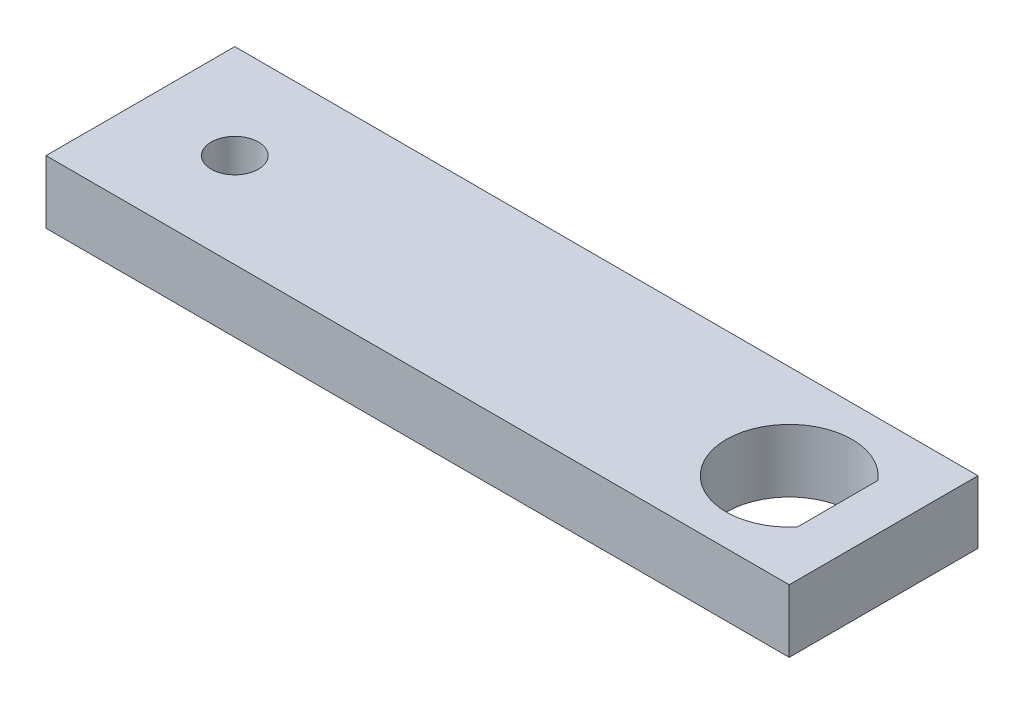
ISO-10303-21;
HEADER;
FILE_DESCRIPTION(('STEP AP214'),'2;1');
FILE_NAME('part.step','',(''),(''),'','','');
FILE_SCHEMA(('AUTOMOTIVE_DESIGN { 1 0 10303 214 1 1 1 1 }'));
ENDSEC;
DATA;
#1=APPLICATION_CONTEXT('core data for automotive mechanical design processes');
#2=APPLICATION_PROTOCOL_DEFINITION('international standard','automotive_design',2000,#1);
#3=PRODUCT_CONTEXT('',#1,'mechanical');
#4=PRODUCT('Part','Part','',(#3));
#5=PRODUCT_RELATED_PRODUCT_CATEGORY('part','',(#4));
#6=PRODUCT_DEFINITION_FORMATION('','',#4);
#7=PRODUCT_DEFINITION_CONTEXT('part definition',#1,'design');
#8=PRODUCT_DEFINITION('design','',#6,#7);
#9=PRODUCT_DEFINITION_SHAPE('','',#8);
#10=(LENGTH_UNIT() NAMED_UNIT(*) SI_UNIT(.MILLI.,.METRE.));
#11=(NAMED_UNIT(*) PLANE_ANGLE_UNIT() SI_UNIT($,.RADIAN.));
#12=(NAMED_UNIT(*) SI_UNIT($,.STERADIAN.) SOLID_ANGLE_UNIT());
#13=UNCERTAINTY_MEASURE_WITH_UNIT(LENGTH_MEASURE(1.E-05),#10,'distance_accuracy_value','');
#14=(GEOMETRIC_REPRESENTATION_CONTEXT(3) GLOBAL_UNCERTAINTY_ASSIGNED_CONTEXT((#13)) GLOBAL_UNIT_ASSIGNED_CONTEXT((#10,
#11,#12)) REPRESENTATION_CONTEXT('',''));
#15=CARTESIAN_POINT('',(0.,0.,0.));
#16=DIRECTION('',(0.,0.,1.));
#17=DIRECTION('',(1.,0.,0.));
#18=AXIS2_PLACEMENT_3D('',#15,#16,#17);
#19=CARTESIAN_POINT('',(0.,0.,19.05));
#20=DIRECTION('',(-1.,0.,0.));
#21=DIRECTION('',(0.,0.,1.));
#22=AXIS2_PLACEMENT_3D('',#19,#20,#21);
#23=PLANE('',#22);
#24=DIRECTION('',(0.,1.,0.));
#25=VECTOR('',#24,1.);
#26=CARTESIAN_POINT('',(0.,0.,0.));
#27=LINE('',#26,#25);
#28=CARTESIAN_POINT('',(0.,0.,0.));
#29=VERTEX_POINT('',#28);
#30=CARTESIAN_POINT('',(0.,6.35000000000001,0.));
#31=VERTEX_POINT('',#30);
#32=EDGE_CURVE('E111',#29,#31,#27,.T.);
#33=ORIENTED_EDGE('',*,*,#32,.F.);
#34=DIRECTION('',(0.,0.,-1.));
#35=VECTOR('',#34,1.);
#36=CARTESIAN_POINT('',(0.,0.,19.05));
#37=LINE('',#36,#35);
#38=CARTESIAN_POINT('',(0.,0.,19.05));
#39=VERTEX_POINT('',#38);
#40=EDGE_CURVE('E11',#39,#29,#37,.T.);
#41=ORIENTED_EDGE('',*,*,#40,.F.);
#42=DIRECTION('',(0.,1.,0.));
#43=VECTOR('',#42,1.);
#44=CARTESIAN_POINT('',(0.,0.,19.05));
#45=LINE('',#44,#43);
#46=CARTESIAN_POINT('',(0.,6.35000000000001,19.05));
#47=VERTEX_POINT('',#46);
#48=EDGE_CURVE('E117',#39,#47,#45,.T.);
#49=ORIENTED_EDGE('',*,*,#48,.T.);
#50=DIRECTION('',(0.,0.,-1.));
#51=VECTOR('',#50,1.);
#52=CARTESIAN_POINT('',(0.,6.35000000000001,19.05));
#53=LINE('',#52,#51);
#54=EDGE_CURVE('E42',#47,#31,#53,.T.);
#55=ORIENTED_EDGE('',*,*,#54,.T.);
#56=EDGE_LOOP('',(#33,#41,#49,#55));
#57=FACE_BOUND('',#56,.T.);
#58=ADVANCED_FACE('F41',(#57),#23,.T.);
#59=CARTESIAN_POINT('',(0.,0.,19.05));
#60=DIRECTION('',(0.,1.,0.));
#61=DIRECTION('',(0.,0.,1.));
#62=AXIS2_PLACEMENT_3D('',#59,#60,#61);
#63=PLANE('',#62);
#64=CARTESIAN_POINT('',(9.525,0.,9.525));
#65=DIRECTION('',(0.,1.,0.));
#66=DIRECTION('',(-1.,0.,0.));
#67=AXIS2_PLACEMENT_3D('',#64,#65,#66);
#68=CIRCLE('',#67,2.38125);
#69=CARTESIAN_POINT('',(7.14375,0.,9.525));
#70=VERTEX_POINT('',#69);
#71=EDGE_CURVE('E115',#70,#70,#68,.T.);
#72=ORIENTED_EDGE('',*,*,#71,.T.);
#73=EDGE_LOOP('',(#72));
#74=FACE_BOUND('',#73,.T.);
#75=DIRECTION('',(0.,0.,1.));
#76=VECTOR('',#75,1.);
#77=CARTESIAN_POINT('',(70.3645,0.,5.47342132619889));
#78=LINE('',#77,#76);
#79=CARTESIAN_POINT('',(70.3645,0.,5.47342132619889));
#80=VERTEX_POINT('',#79);
#81=CARTESIAN_POINT('',(70.3645,0.,13.5765786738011));
#82=VERTEX_POINT('',#81);
#83=EDGE_CURVE('E91',#80,#82,#78,.T.);
#84=ORIENTED_EDGE('',*,*,#83,.F.);
#85=CARTESIAN_POINT('',(65.475,0.,9.525));
#86=DIRECTION('',(0.,1.,0.));
#87=DIRECTION('',(-1.,0.,0.));
#88=AXIS2_PLACEMENT_3D('',#85,#86,#87);
#89=CIRCLE('',#88,6.35);
#90=EDGE_CURVE('E60',#80,#82,#89,.T.);
#91=ORIENTED_EDGE('',*,*,#90,.T.);
#92=EDGE_LOOP('',(#84,#91));
#93=FACE_BOUND('',#92,.T.);
#94=DIRECTION('',(1.,0.,0.));
#95=VECTOR('',#94,1.);
#96=CARTESIAN_POINT('',(0.,0.,0.));
#97=LINE('',#96,#95);
#98=CARTESIAN_POINT('',(75.,0.,0.));
#99=VERTEX_POINT('',#98);
#100=EDGE_CURVE('E116',#29,#99,#97,.T.);
#101=ORIENTED_EDGE('',*,*,#100,.T.);
#102=DIRECTION('',(0.,0.,-1.));
#103=VECTOR('',#102,1.);
#104=CARTESIAN_POINT('',(75.,0.,19.05));
#105=LINE('',#104,#103);
#106=CARTESIAN_POINT('',(75.,0.,19.05));
#107=VERTEX_POINT('',#106);
#108=EDGE_CURVE('E47',#107,#99,#105,.T.);
#109=ORIENTED_EDGE('',*,*,#108,.F.);
#110=DIRECTION('',(1.,0.,0.));
#111=VECTOR('',#110,1.);
#112=CARTESIAN_POINT('',(0.,0.,19.05));
#113=LINE('',#112,#111);
#114=EDGE_CURVE('E124',#39,#107,#113,.T.);
#115=ORIENTED_EDGE('',*,*,#114,.F.);
#116=ORIENTED_EDGE('',*,*,#40,.T.);
#117=EDGE_LOOP('',(#101,#109,#115,#116));
#118=FACE_BOUND('',#117,.T.);
#119=ADVANCED_FACE('F103',(#74,#93,#118),#63,.F.);
#120=CARTESIAN_POINT('',(75.,6.34999999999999,19.05));
#121=DIRECTION('',(1.,0.,0.));
#122=DIRECTION('',(0.,0.,-1.));
#123=AXIS2_PLACEMENT_3D('',#120,#121,#122);
#124=PLANE('',#123);
#125=DIRECTION('',(0.,-1.,0.));
#126=VECTOR('',#125,1.);
#127=CARTESIAN_POINT('',(75.,6.34999999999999,0.));
#128=LINE('',#127,#126);
#129=CARTESIAN_POINT('',(75.,6.34999999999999,0.));
#130=VERTEX_POINT('',#129);
#131=EDGE_CURVE('E134',#130,#99,#128,.T.);
#132=ORIENTED_EDGE('',*,*,#131,.F.);
#133=DIRECTION('',(0.,0.,-1.));
#134=VECTOR('',#133,1.);
#135=CARTESIAN_POINT('',(75.,6.34999999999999,19.05));
#136=LINE('',#135,#134);
#137=CARTESIAN_POINT('',(75.,6.34999999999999,19.05));
#138=VERTEX_POINT('',#137);
#139=EDGE_CURVE('E140',#138,#130,#136,.T.);
#140=ORIENTED_EDGE('',*,*,#139,.F.);
#141=DIRECTION('',(0.,-1.,0.));
#142=VECTOR('',#141,1.);
#143=CARTESIAN_POINT('',(75.,6.34999999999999,19.05));
#144=LINE('',#143,#142);
#145=EDGE_CURVE('E125',#138,#107,#144,.T.);
#146=ORIENTED_EDGE('',*,*,#145,.T.);
#147=ORIENTED_EDGE('',*,*,#108,.T.);
#148=EDGE_LOOP('',(#132,#140,#146,#147));
#149=FACE_BOUND('',#148,.T.);
#150=ADVANCED_FACE('F160',(#149),#124,.T.);
#151=CARTESIAN_POINT('',(75.,6.34999999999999,19.05));
#152=DIRECTION('',(0.,-1.,0.));
#153=DIRECTION('',(1.,0.,0.));
#154=AXIS2_PLACEMENT_3D('',#151,#152,#153);
#155=PLANE('',#154);
#156=CARTESIAN_POINT('',(9.525,6.35000000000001,9.525));
#157=DIRECTION('',(0.,1.,0.));
#158=DIRECTION('',(-1.,0.,0.));
#159=AXIS2_PLACEMENT_3D('',#156,#157,#158);
#160=CIRCLE('',#159,2.38125);
#161=CARTESIAN_POINT('',(7.14375,6.35000000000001,9.525));
#162=VERTEX_POINT('',#161);
#163=EDGE_CURVE('E108',#162,#162,#160,.T.);
#164=ORIENTED_EDGE('',*,*,#163,.F.);
#165=EDGE_LOOP('',(#164));
#166=FACE_BOUND('',#165,.T.);
#167=DIRECTION('',(0.,0.,1.));
#168=VECTOR('',#167,1.);
#169=CARTESIAN_POINT('',(70.3645,6.35,5.47342132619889));
#170=LINE('',#169,#168);
#171=CARTESIAN_POINT('',(70.3645,6.35,5.47342132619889));
#172=VERTEX_POINT('',#171);
#173=CARTESIAN_POINT('',(70.3645,6.35,13.5765786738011));
#174=VERTEX_POINT('',#173);
#175=EDGE_CURVE('E104',#172,#174,#170,.T.);
#176=ORIENTED_EDGE('',*,*,#175,.T.);
#177=CARTESIAN_POINT('',(65.475,6.35000000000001,9.525));
#178=DIRECTION('',(0.,1.,0.));
#179=DIRECTION('',(-1.,0.,0.));
#180=AXIS2_PLACEMENT_3D('',#177,#178,#179);
#181=CIRCLE('',#180,6.35);
#182=EDGE_CURVE('E65',#172,#174,#181,.T.);
#183=ORIENTED_EDGE('',*,*,#182,.F.);
#184=EDGE_LOOP('',(#176,#183));
#185=FACE_BOUND('',#184,.T.);
#186=DIRECTION('',(-1.,0.,0.));
#187=VECTOR('',#186,1.);
#188=CARTESIAN_POINT('',(75.,6.34999999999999,0.));
#189=LINE('',#188,#187);
#190=EDGE_CURVE('E129',#130,#31,#189,.T.);
#191=ORIENTED_EDGE('',*,*,#190,.T.);
#192=ORIENTED_EDGE('',*,*,#54,.F.);
#193=DIRECTION('',(-1.,0.,0.));
#194=VECTOR('',#193,1.);
#195=CARTESIAN_POINT('',(75.,6.34999999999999,19.05));
#196=LINE('',#195,#194);
#197=EDGE_CURVE('E119',#138,#47,#196,.T.);
#198=ORIENTED_EDGE('',*,*,#197,.F.);
#199=ORIENTED_EDGE('',*,*,#139,.T.);
#200=EDGE_LOOP('',(#191,#192,#198,#199));
#201=FACE_BOUND('',#200,.T.);
#202=ADVANCED_FACE('F148',(#166,#185,#201),#155,.F.);
#203=CARTESIAN_POINT('',(0.,0.,19.05));
#204=DIRECTION('',(0.,0.,-1.));
#205=DIRECTION('',(-1.,0.,0.));
#206=AXIS2_PLACEMENT_3D('',#203,#204,#205);
#207=PLANE('',#206);
#208=ORIENTED_EDGE('',*,*,#48,.F.);
#209=ORIENTED_EDGE('',*,*,#114,.T.);
#210=ORIENTED_EDGE('',*,*,#145,.F.);
#211=ORIENTED_EDGE('',*,*,#197,.T.);
#212=EDGE_LOOP('',(#208,#209,#210,#211));
#213=FACE_BOUND('',#212,.T.);
#214=ADVANCED_FACE('F154',(#213),#207,.F.);
#215=CARTESIAN_POINT('',(0.,0.,0.));
#216=DIRECTION('',(0.,0.,-1.));
#217=DIRECTION('',(-1.,0.,0.));
#218=AXIS2_PLACEMENT_3D('',#215,#216,#217);
#219=PLANE('',#218);
#220=ORIENTED_EDGE('',*,*,#32,.T.);
#221=ORIENTED_EDGE('',*,*,#190,.F.);
#222=ORIENTED_EDGE('',*,*,#131,.T.);
#223=ORIENTED_EDGE('',*,*,#100,.F.);
#224=EDGE_LOOP('',(#220,#221,#222,#223));
#225=FACE_BOUND('',#224,.T.);
#226=ADVANCED_FACE('F147',(#225),#219,.T.);
#227=CARTESIAN_POINT('',(65.475,0.,9.525));
#228=DIRECTION('',(0.,1.,0.));
#229=DIRECTION('',(-1.,0.,0.));
#230=AXIS2_PLACEMENT_3D('',#227,#228,#229);
#231=CYLINDRICAL_SURFACE('',#230,6.35);
#232=ORIENTED_EDGE('',*,*,#182,.T.);
#233=DIRECTION('',(0.,1.,0.));
#234=VECTOR('',#233,1.);
#235=CARTESIAN_POINT('',(70.3645,0.,13.5765786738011));
#236=LINE('',#235,#234);
#237=EDGE_CURVE('E96',#82,#174,#236,.T.);
#238=ORIENTED_EDGE('',*,*,#237,.F.);
#239=ORIENTED_EDGE('',*,*,#90,.F.);
#240=DIRECTION('',(0.,1.,0.));
#241=VECTOR('',#240,1.);
#242=CARTESIAN_POINT('',(70.3645,0.,5.47342132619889));
#243=LINE('',#242,#241);
#244=EDGE_CURVE('E98',#80,#172,#243,.T.);
#245=ORIENTED_EDGE('',*,*,#244,.T.);
#246=EDGE_LOOP('',(#232,#238,#239,#245));
#247=FACE_BOUND('',#246,.T.);
#248=ADVANCED_FACE('F101',(#247),#231,.F.);
#249=CARTESIAN_POINT('',(70.3645,0.,5.47342132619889));
#250=DIRECTION('',(-1.,0.,0.));
#251=DIRECTION('',(0.,-1.,0.));
#252=AXIS2_PLACEMENT_3D('',#249,#250,#251);
#253=PLANE('',#252);
#254=ORIENTED_EDGE('',*,*,#175,.F.);
#255=ORIENTED_EDGE('',*,*,#244,.F.);
#256=ORIENTED_EDGE('',*,*,#83,.T.);
#257=ORIENTED_EDGE('',*,*,#237,.T.);
#258=EDGE_LOOP('',(#254,#255,#256,#257));
#259=FACE_BOUND('',#258,.T.);
#260=ADVANCED_FACE('F92',(#259),#253,.T.);
#261=CARTESIAN_POINT('',(9.525,0.,9.525));
#262=DIRECTION('',(0.,1.,0.));
#263=DIRECTION('',(-1.,0.,0.));
#264=AXIS2_PLACEMENT_3D('',#261,#262,#263);
#265=CYLINDRICAL_SURFACE('',#264,2.38125);
#266=CARTESIAN_POINT('',(7.14375,0.,9.525));
#267=CARTESIAN_POINT('',(7.14375,0.0661458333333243,9.525));
#268=CARTESIAN_POINT('',(7.14375,0.132291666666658,9.525));
#269=CARTESIAN_POINT('',(7.14375,0.264583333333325,9.525));
#270=CARTESIAN_POINT('',(7.14375,0.330729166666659,9.525));
#271=CARTESIAN_POINT('',(7.14375,0.463020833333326,9.525));
#272=CARTESIAN_POINT('',(7.14375,0.529166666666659,9.525));
#273=CARTESIAN_POINT('',(7.14375,0.661458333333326,9.525));
#274=CARTESIAN_POINT('',(7.14375,0.72760416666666,9.525));
#275=CARTESIAN_POINT('',(7.14375,0.859895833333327,9.525));
#276=CARTESIAN_POINT('',(7.14375,0.926041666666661,9.525));
#277=CARTESIAN_POINT('',(7.14375,1.05833333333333,9.525));
#278=CARTESIAN_POINT('',(7.14375,1.12447916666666,9.525));
#279=CARTESIAN_POINT('',(7.14375,1.25677083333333,9.525));
#280=CARTESIAN_POINT('',(7.14375,1.32291666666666,9.525));
#281=CARTESIAN_POINT('',(7.14375,1.45520833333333,9.525));
#282=CARTESIAN_POINT('',(7.14375,1.52135416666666,9.525));
#283=CARTESIAN_POINT('',(7.14375,1.65364583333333,9.525));
#284=CARTESIAN_POINT('',(7.14375,1.71979166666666,9.525));
#285=CARTESIAN_POINT('',(7.14375,1.85208333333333,9.525));
#286=CARTESIAN_POINT('',(7.14375,1.91822916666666,9.525));
#287=CARTESIAN_POINT('',(7.14375,2.05052083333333,9.525));
#288=CARTESIAN_POINT('',(7.14375,2.11666666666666,9.525));
#289=CARTESIAN_POINT('',(7.14375,2.24895833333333,9.525));
#290=CARTESIAN_POINT('',(7.14375,2.31510416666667,9.525));
#291=CARTESIAN_POINT('',(7.14375,2.44739583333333,9.525));
#292=CARTESIAN_POINT('',(7.14375,2.51354166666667,9.525));
#293=CARTESIAN_POINT('',(7.14375,2.64583333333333,9.525));
#294=CARTESIAN_POINT('',(7.14375,2.71197916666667,9.525));
#295=CARTESIAN_POINT('',(7.14375,2.84427083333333,9.525));
#296=CARTESIAN_POINT('',(7.14375,2.91041666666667,9.525));
#297=CARTESIAN_POINT('',(7.14375,3.04270833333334,9.525));
#298=CARTESIAN_POINT('',(7.14375,3.10885416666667,9.525));
#299=CARTESIAN_POINT('',(7.14375,3.24114583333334,9.525));
#300=CARTESIAN_POINT('',(7.14375,3.30729166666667,9.525));
#301=CARTESIAN_POINT('',(7.14375,3.43958333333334,9.525));
#302=CARTESIAN_POINT('',(7.14375,3.50572916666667,9.525));
#303=CARTESIAN_POINT('',(7.14375,3.63802083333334,9.525));
#304=CARTESIAN_POINT('',(7.14375,3.70416666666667,9.525));
#305=CARTESIAN_POINT('',(7.14375,3.83645833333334,9.525));
#306=CARTESIAN_POINT('',(7.14375,3.90260416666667,9.525));
#307=CARTESIAN_POINT('',(7.14375,4.03489583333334,9.525));
#308=CARTESIAN_POINT('',(7.14375,4.10104166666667,9.525));
#309=CARTESIAN_POINT('',(7.14375,4.23333333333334,9.525));
#310=CARTESIAN_POINT('',(7.14375,4.29947916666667,9.525));
#311=CARTESIAN_POINT('',(7.14375,4.43177083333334,9.525));
#312=CARTESIAN_POINT('',(7.14375,4.49791666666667,9.525));
#313=CARTESIAN_POINT('',(7.14375,4.63020833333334,9.525));
#314=CARTESIAN_POINT('',(7.14375,4.69635416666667,9.525));
#315=CARTESIAN_POINT('',(7.14375,4.82864583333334,9.525));
#316=CARTESIAN_POINT('',(7.14375,4.89479166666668,9.525));
#317=CARTESIAN_POINT('',(7.14375,5.02708333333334,9.525));
#318=CARTESIAN_POINT('',(7.14375,5.09322916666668,9.525));
#319=CARTESIAN_POINT('',(7.14375,5.22552083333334,9.525));
#320=CARTESIAN_POINT('',(7.14375,5.29166666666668,9.525));
#321=CARTESIAN_POINT('',(7.14375,5.42395833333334,9.525));
#322=CARTESIAN_POINT('',(7.14375,5.49010416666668,9.525));
#323=CARTESIAN_POINT('',(7.14375,5.62239583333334,9.525));
#324=CARTESIAN_POINT('',(7.14375,5.68854166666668,9.525));
#325=CARTESIAN_POINT('',(7.14375,5.82083333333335,9.525));
#326=CARTESIAN_POINT('',(7.14375,5.88697916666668,9.525));
#327=CARTESIAN_POINT('',(7.14375,6.01927083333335,9.525));
#328=CARTESIAN_POINT('',(7.14375,6.08541666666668,9.525));
#329=CARTESIAN_POINT('',(7.14375,6.21770833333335,9.525));
#330=CARTESIAN_POINT('',(7.14375,6.28385416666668,9.525));
#331=CARTESIAN_POINT('',(7.14375,6.35000000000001,9.525));
#332=B_SPLINE_CURVE_WITH_KNOTS('',3,(#266,#267,#268,#269,#270,#271,#272,#273,#274,#275,#276,
#277,#278,#279,#280,#281,#282,#283,#284,#285,#286,#287,#288,#289,#290,#291,#292,#293,#294,#295,
#296,#297,#298,#299,#300,#301,#302,#303,#304,#305,#306,#307,#308,#309,#310,#311,#312,#313,#314,
#315,#316,#317,#318,#319,#320,#321,#322,#323,#324,#325,#326,#327,#328,#329,#330,#331),
.UNSPECIFIED.,.F.,.F.,(4,2,2,2,2,2,2,2,2,2,2,2,2,2,2,2,2,2,2,2,2,2,2,2,2,2,2,2,2,2,2,2,4),(0.,
0.198437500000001,0.396875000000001,0.595312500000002,0.793750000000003,0.992187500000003,
1.190625,1.38906250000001,1.58750000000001,1.78593750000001,1.98437500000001,2.18281250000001,
2.38125000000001,2.57968750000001,2.77812500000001,2.97656250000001,3.17500000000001,
3.37343750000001,3.57187500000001,3.77031250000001,3.96875000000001,4.16718750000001,
4.36562500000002,4.56406250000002,4.76250000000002,4.96093750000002,5.15937500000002,
5.35781250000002,5.55625000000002,5.75468750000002,5.95312500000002,6.15156250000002,
6.35000000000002),.UNSPECIFIED.);
#333=EDGE_CURVE('BSEAM201',#70,#162,#332,.T.);
#334=ORIENTED_EDGE('',*,*,#71,.F.);
#335=ORIENTED_EDGE('',*,*,#163,.T.);
#336=ORIENTED_EDGE('',*,*,#333,.T.);
#337=ORIENTED_EDGE('',*,*,#333,.F.);
#338=EDGE_LOOP('',(#334,#336,#335,#337));
#339=FACE_BOUND('',#338,.T.);
#340=ADVANCED_FACE('F201',(#339),#265,.F.);
#341=CLOSED_SHELL('',(#58,#119,#150,#202,#214,#226,#248,#260,#340));
#342=MANIFOLD_SOLID_BREP('B2',#341);
#343=ADVANCED_BREP_SHAPE_REPRESENTATION('',(#18,#342),#14);
#344=SHAPE_DEFINITION_REPRESENTATION(#9,#343);
ENDSEC;
END-ISO-10303-21;
